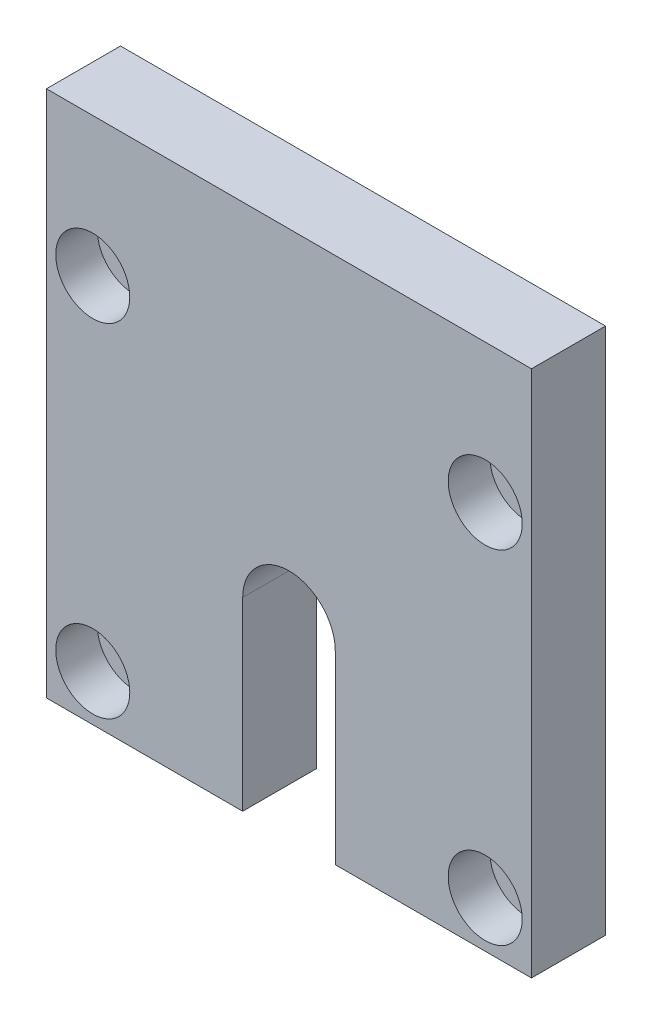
from build123d import *

# Parameters (mm, degrees)
SKETCH_1_R          = 2.25
EXTRUDE_1_DEPTH     = 8
SKETCH_2_R          = 4
CUT_EXTRUDE_1_DEPTH = 4.5


with BuildPart() as part:
    # Sketch 1 → Extrude 1 (new body)
    with BuildSketch(Plane.XY):
        with BuildLine():
            Line((0, 0), (0, 57))
            Line((0, 57), (52.4, 57))
            Line((52.4, 57), (52.4, 0))
            Line((52.4, 0), (31.2, 0))
            Line((31.2, 0), (31.2, 20))
            ThreePointArc((31.2, 20), (26.2, 25), (21.2, 20))
            Line((21.2, 20), (21.2, 0))
            Line((21.2, 0), (0, 0))
        make_face()
        with Locations((5, 42)):
            Circle(SKETCH_1_R, mode=Mode.SUBTRACT)
        with Locations((47.4, 42)):
            Circle(SKETCH_1_R, mode=Mode.SUBTRACT)
        with Locations((47.4, 5)):
            Circle(SKETCH_1_R, mode=Mode.SUBTRACT)
        with Locations((5, 5)):
            Circle(SKETCH_1_R, mode=Mode.SUBTRACT)
    extrude(amount=EXTRUDE_1_DEPTH)

    # Sketch 2 → Cut-Extrude 1 (cut)
    with BuildSketch(Plane.XY.offset(8)):
        with Locations((5, 42)):
            Circle(SKETCH_2_R)
        with Locations((47.4, 42)):
            Circle(SKETCH_2_R)
        with Locations((47.4, 5)):
            Circle(SKETCH_2_R)
        with Locations((5, 5)):
            Circle(SKETCH_2_R)
    extrude(amount=-CUT_EXTRUDE_1_DEPTH, mode=Mode.SUBTRACT)


solid = part.part
